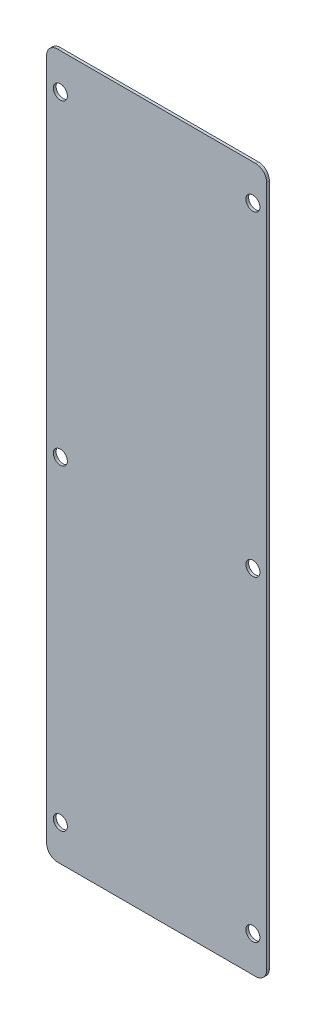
from build123d import *

# Parameters (mm, degrees)
SKETCH1_W           = 80
SKETCH1_H           = 256
BOSS_EXTRUDE1_DEPTH = 1
FILLET1_R           = 4
SKETCH2_R           = 2.55
CUT_EXTRUDE1_DEPTH  = 135.1081653


with BuildPart() as part:
    # Sketch1 → Boss-Extrude1 (new body)
    with BuildSketch(Plane.XY):
        Rectangle(SKETCH1_W, SKETCH1_H)
    extrude(amount=BOSS_EXTRUDE1_DEPTH)

    # Fillet1
    fillet1_edges = [part.edges().sort_by_distance(p)[0] for p in [
        (40, -128, 0.5),
        (-40, -128, 0.5),
        (-40, 128, 0.5),
        (40, 128, 0.5),
    ]]
    fillet(fillet1_edges, radius=FILLET1_R)

    # Sketch2 → Cut-Extrude1 (cut, through all)
    with BuildSketch(Plane.XY.offset(1)):
        with Locations((35, -115)):
            Circle(SKETCH2_R)
        with Locations((-35, -115)):
            Circle(SKETCH2_R)
        with Locations((-35, 0)):
            Circle(SKETCH2_R)
        with Locations((35, 0)):
            Circle(SKETCH2_R)
        with Locations((35, 115)):
            Circle(SKETCH2_R)
        with Locations((-35, 115)):
            Circle(SKETCH2_R)
    extrude(amount=-CUT_EXTRUDE1_DEPTH, mode=Mode.SUBTRACT)


solid = part.part
